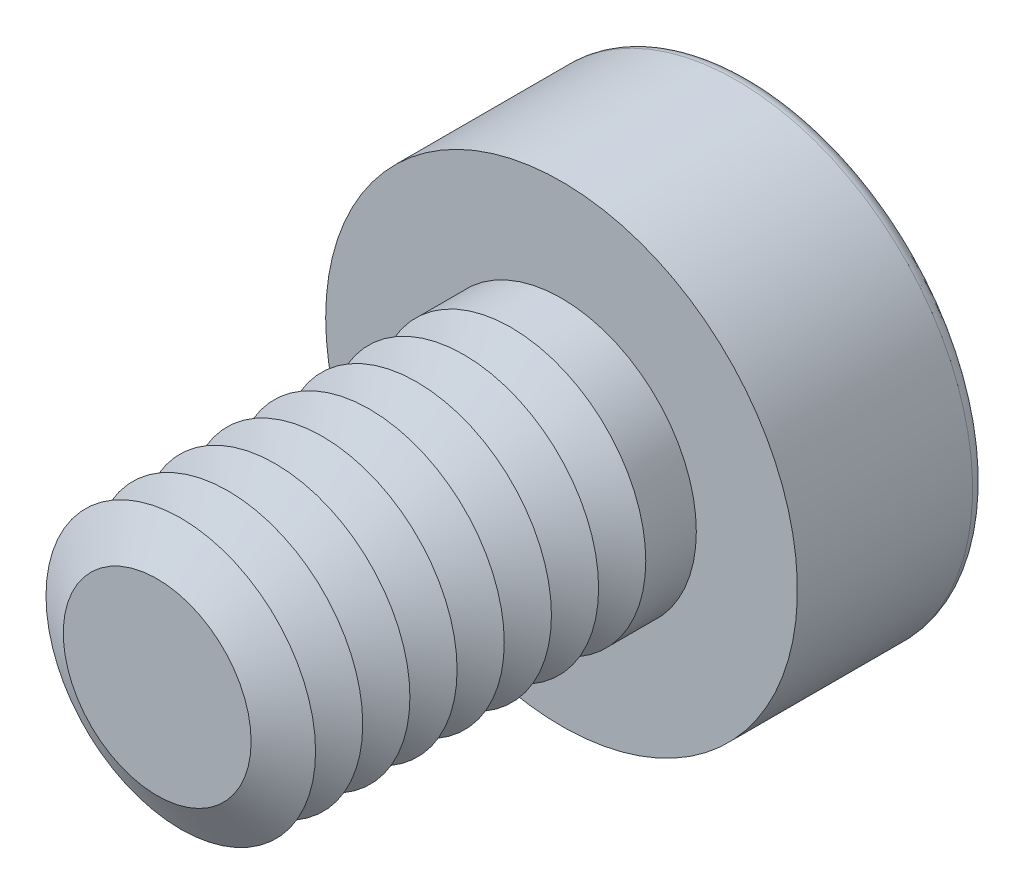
from build123d import *

# Parameters (mm, degrees)
SKETCH1_R           = 2
BOSS_EXTRUDE1_DEPTH = 6
SKETCH2_R           = 3.5
BOSS_EXTRUDE2_DEPTH = 2.8
CUT_EXTRUDE1_DEPTH  = 1.875
FILLET1_R           = 0.2
LPATTERN1_COUNT     = 8
LPATTERN1_PITCH     = 0.7


with BuildPart() as part:
    # Sketch1 → Boss-Extrude1 (new body)
    with BuildSketch(Plane.XY):
        Circle(SKETCH1_R)
    extrude(amount=BOSS_EXTRUDE1_DEPTH)

    # Sketch2 → Boss-Extrude2 (add)
    with BuildSketch(Plane(origin=(0, 0, 0), x_dir=(-1, 0, 0), z_dir=(0, 0, -1))):
        Circle(SKETCH2_R)
    extrude(amount=BOSS_EXTRUDE2_DEPTH)

    # Sketch3 → Cut-Extrude1 (cut)
    with BuildSketch(Plane(origin=(0, 0, -2.8), x_dir=(-1, 0, 0), z_dir=(0, 0, -1))):
        Polygon((-0.721687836, 1.25), (-1.443375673, 0), (-0.721687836, -1.25), (0.721687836, -1.25), (1.443375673, 0), (0.721687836, 1.25), align=None)
    extrude(amount=-CUT_EXTRUDE1_DEPTH, mode=Mode.SUBTRACT)

    # Fillet1
    fillet1_edges = [part.edges().sort_by_distance(p)[0] for p in [
        (3.5, 0, -2.8),
    ]]
    fillet(fillet1_edges, radius=FILLET1_R)

    # Cut-Extrude2 cone 1 section (on through the dimple's axis) → Cut-Extrude2 (revolve, cut)
    with BuildSketch(Plane(origin=(0, 0, -0.925), x_dir=(0, 1, 0), z_dir=(1, 0, 0))):
        Polygon((0, 0), (1.25, 0), (0, 0.721687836), align=None)
    revolve(axis=Axis((0, 0, -0.925), (0, 0, 1)), mode=Mode.SUBTRACT)

    # Cut-Extrude3 cone 1 section (on through the dimple's axis) → Cut-Extrude3 (revolve, cut)
    with BuildSketch(Plane(origin=(0, 0, -2.8), x_dir=(0, 1, 0), z_dir=(1, 0, 0))):
        Polygon((0, 0), (1.443375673, 0), (0, 0.386751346), align=None)
    revolve(axis=Axis((0, 0, -2.8), (0, 0, 1)), mode=Mode.SUBTRACT)

    # Sketch7 → Cut-Revolve1 (revolve, cut)
    with BuildSketch(Plane(origin=(0, 0, 0), x_dir=(0, 0, -1), z_dir=(1, 0, 0)), mode=Mode.PRIVATE) as cut_revolve1_sk:
        Polygon((-6, 1.393782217), (-5.65, 2), (-6.35, 2), align=None)
    cut_revolve1 = revolve(cut_revolve1_sk.sketch.rotate(Axis((0, 0, 6), (0, 0, -1)), 90), axis=Axis((0, 0, 6), (0, 0, -1)), mode=Mode.SUBTRACT)

    # LPattern1: Cut-Revolve1 ×8
    with Locations(*[(0, 0, -i * LPATTERN1_PITCH) for i in range(1, LPATTERN1_COUNT)]):
        add(cut_revolve1, mode=Mode.SUBTRACT)


solid = part.part
